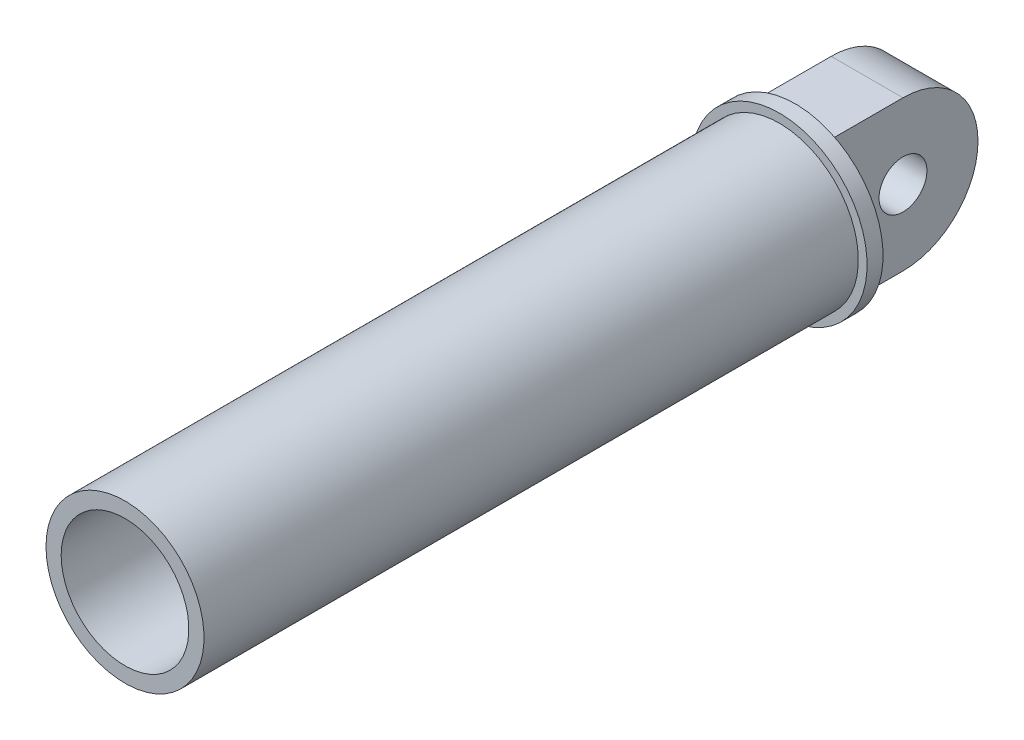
ISO-10303-21;
HEADER;
FILE_DESCRIPTION(('STEP AP214'),'2;1');
FILE_NAME('part.step','',(''),(''),'','','');
FILE_SCHEMA(('AUTOMOTIVE_DESIGN { 1 0 10303 214 1 1 1 1 }'));
ENDSEC;
DATA;
#1=APPLICATION_CONTEXT('core data for automotive mechanical design processes');
#2=APPLICATION_PROTOCOL_DEFINITION('international standard','automotive_design',2000,#1);
#3=PRODUCT_CONTEXT('',#1,'mechanical');
#4=PRODUCT('Part','Part','',(#3));
#5=PRODUCT_RELATED_PRODUCT_CATEGORY('part','',(#4));
#6=PRODUCT_DEFINITION_FORMATION('','',#4);
#7=PRODUCT_DEFINITION_CONTEXT('part definition',#1,'design');
#8=PRODUCT_DEFINITION('design','',#6,#7);
#9=PRODUCT_DEFINITION_SHAPE('','',#8);
#10=(LENGTH_UNIT() NAMED_UNIT(*) SI_UNIT(.MILLI.,.METRE.));
#11=(NAMED_UNIT(*) PLANE_ANGLE_UNIT() SI_UNIT($,.RADIAN.));
#12=(NAMED_UNIT(*) SI_UNIT($,.STERADIAN.) SOLID_ANGLE_UNIT());
#13=UNCERTAINTY_MEASURE_WITH_UNIT(LENGTH_MEASURE(1.E-05),#10,'distance_accuracy_value','');
#14=(GEOMETRIC_REPRESENTATION_CONTEXT(3) GLOBAL_UNCERTAINTY_ASSIGNED_CONTEXT((#13)) GLOBAL_UNIT_ASSIGNED_CONTEXT((#10,
#11,#12)) REPRESENTATION_CONTEXT('',''));
#15=CARTESIAN_POINT('',(0.,0.,0.));
#16=DIRECTION('',(0.,0.,1.));
#17=DIRECTION('',(1.,0.,0.));
#18=AXIS2_PLACEMENT_3D('',#15,#16,#17);
#19=CARTESIAN_POINT('',(0.,0.,-10.));
#20=DIRECTION('',(0.,0.,-1.));
#21=DIRECTION('',(-1.,0.,0.));
#22=AXIS2_PLACEMENT_3D('',#19,#20,#21);
#23=PLANE('',#22);
#24=CARTESIAN_POINT('',(0.,0.,-10.));
#25=DIRECTION('',(0.,0.,-1.));
#26=DIRECTION('',(-1.,0.,0.));
#27=AXIS2_PLACEMENT_3D('',#24,#25,#26);
#28=CIRCLE('',#27,55.);
#29=CARTESIAN_POINT('',(-55.,0.,-10.));
#30=VERTEX_POINT('',#29);
#31=EDGE_CURVE('E127',#30,#30,#28,.T.);
#32=ORIENTED_EDGE('',*,*,#31,.T.);
#33=EDGE_LOOP('',(#32));
#34=FACE_BOUND('',#33,.T.);
#35=DIRECTION('',(0.,-1.,0.));
#36=VECTOR('',#35,1.);
#37=CARTESIAN_POINT('',(22.5,47.,-10.));
#38=LINE('',#37,#36);
#39=CARTESIAN_POINT('',(22.5,47.,-10.));
#40=VERTEX_POINT('',#39);
#41=CARTESIAN_POINT('',(22.5,-47.,-10.));
#42=VERTEX_POINT('',#41);
#43=EDGE_CURVE('E118',#40,#42,#38,.T.);
#44=ORIENTED_EDGE('',*,*,#43,.F.);
#45=DIRECTION('',(-1.,0.,0.));
#46=VECTOR('',#45,1.);
#47=CARTESIAN_POINT('',(22.5,47.,-10.));
#48=LINE('',#47,#46);
#49=CARTESIAN_POINT('',(-22.5,47.,-10.));
#50=VERTEX_POINT('',#49);
#51=EDGE_CURVE('E100',#40,#50,#48,.T.);
#52=ORIENTED_EDGE('',*,*,#51,.T.);
#53=DIRECTION('',(0.,-1.,0.));
#54=VECTOR('',#53,1.);
#55=CARTESIAN_POINT('',(-22.5,47.,-10.));
#56=LINE('',#55,#54);
#57=CARTESIAN_POINT('',(-22.5,-47.,-10.));
#58=VERTEX_POINT('',#57);
#59=EDGE_CURVE('E88',#50,#58,#56,.T.);
#60=ORIENTED_EDGE('',*,*,#59,.T.);
#61=DIRECTION('',(-1.,0.,0.));
#62=VECTOR('',#61,1.);
#63=CARTESIAN_POINT('',(22.5,-47.,-10.));
#64=LINE('',#63,#62);
#65=EDGE_CURVE('E122',#42,#58,#64,.T.);
#66=ORIENTED_EDGE('',*,*,#65,.F.);
#67=EDGE_LOOP('',(#44,#52,#60,#66));
#68=FACE_BOUND('',#67,.T.);
#69=ADVANCED_FACE('F41',(#34,#68),#23,.T.);
#70=CARTESIAN_POINT('',(0.,0.,410.));
#71=DIRECTION('',(0.,0.,1.));
#72=DIRECTION('',(1.,0.,0.));
#73=AXIS2_PLACEMENT_3D('',#70,#71,#72);
#74=PLANE('',#73);
#75=CARTESIAN_POINT('',(0.,0.,410.));
#76=DIRECTION('',(0.,0.,1.));
#77=DIRECTION('',(1.,0.,0.));
#78=AXIS2_PLACEMENT_3D('',#75,#76,#77);
#79=CIRCLE('',#78,49.5);
#80=CARTESIAN_POINT('',(-49.5,0.,410.));
#81=VERTEX_POINT('',#80);
#82=EDGE_CURVE('E49',#81,#81,#79,.T.);
#83=ORIENTED_EDGE('',*,*,#82,.T.);
#84=EDGE_LOOP('',(#83));
#85=FACE_BOUND('',#84,.T.);
#86=CARTESIAN_POINT('',(0.,0.,410.));
#87=DIRECTION('',(0.,0.,1.));
#88=DIRECTION('',(1.,0.,0.));
#89=AXIS2_PLACEMENT_3D('',#86,#87,#88);
#90=CIRCLE('',#89,40.);
#91=CARTESIAN_POINT('',(-40.,0.,410.));
#92=VERTEX_POINT('',#91);
#93=EDGE_CURVE('E133',#92,#92,#90,.T.);
#94=ORIENTED_EDGE('',*,*,#93,.F.);
#95=EDGE_LOOP('',(#94));
#96=FACE_BOUND('',#95,.T.);
#97=ADVANCED_FACE('F138',(#85,#96),#74,.T.);
#98=CARTESIAN_POINT('',(0.,0.,410.));
#99=DIRECTION('',(0.,0.,-1.));
#100=DIRECTION('',(-1.,0.,0.));
#101=AXIS2_PLACEMENT_3D('',#98,#99,#100);
#102=CYLINDRICAL_SURFACE('',#101,49.5);
#103=CARTESIAN_POINT('',(0.,0.,0.));
#104=DIRECTION('',(0.,0.,-1.));
#105=DIRECTION('',(-1.,0.,0.));
#106=AXIS2_PLACEMENT_3D('',#103,#104,#105);
#107=CIRCLE('',#106,49.5);
#108=CARTESIAN_POINT('',(-49.5,0.,0.));
#109=VERTEX_POINT('',#108);
#110=EDGE_CURVE('E130',#109,#109,#107,.T.);
#111=CARTESIAN_POINT('',(-49.5,0.,410.));
#112=CARTESIAN_POINT('',(-49.5,0.,405.729166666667));
#113=CARTESIAN_POINT('',(-49.5,0.,401.458333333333));
#114=CARTESIAN_POINT('',(-49.5,0.,392.916666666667));
#115=CARTESIAN_POINT('',(-49.5,0.,388.645833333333));
#116=CARTESIAN_POINT('',(-49.5,0.,380.104166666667));
#117=CARTESIAN_POINT('',(-49.5,0.,375.833333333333));
#118=CARTESIAN_POINT('',(-49.5,0.,367.291666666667));
#119=CARTESIAN_POINT('',(-49.5,0.,363.020833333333));
#120=CARTESIAN_POINT('',(-49.5,0.,354.479166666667));
#121=CARTESIAN_POINT('',(-49.5,0.,350.208333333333));
#122=CARTESIAN_POINT('',(-49.5,0.,341.666666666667));
#123=CARTESIAN_POINT('',(-49.5,0.,337.395833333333));
#124=CARTESIAN_POINT('',(-49.5,0.,328.854166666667));
#125=CARTESIAN_POINT('',(-49.5,0.,324.583333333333));
#126=CARTESIAN_POINT('',(-49.5,0.,316.041666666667));
#127=CARTESIAN_POINT('',(-49.5,0.,311.770833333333));
#128=CARTESIAN_POINT('',(-49.5,0.,303.229166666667));
#129=CARTESIAN_POINT('',(-49.5,0.,298.958333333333));
#130=CARTESIAN_POINT('',(-49.5,0.,290.416666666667));
#131=CARTESIAN_POINT('',(-49.5,0.,286.145833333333));
#132=CARTESIAN_POINT('',(-49.5,0.,277.604166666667));
#133=CARTESIAN_POINT('',(-49.5,0.,273.333333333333));
#134=CARTESIAN_POINT('',(-49.5,0.,264.791666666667));
#135=CARTESIAN_POINT('',(-49.5,0.,260.520833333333));
#136=CARTESIAN_POINT('',(-49.5,0.,251.979166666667));
#137=CARTESIAN_POINT('',(-49.5,0.,247.708333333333));
#138=CARTESIAN_POINT('',(-49.5,0.,239.166666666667));
#139=CARTESIAN_POINT('',(-49.5,0.,234.895833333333));
#140=CARTESIAN_POINT('',(-49.5,0.,226.354166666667));
#141=CARTESIAN_POINT('',(-49.5,0.,222.083333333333));
#142=CARTESIAN_POINT('',(-49.5,0.,213.541666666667));
#143=CARTESIAN_POINT('',(-49.5,0.,209.270833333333));
#144=CARTESIAN_POINT('',(-49.5,0.,200.729166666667));
#145=CARTESIAN_POINT('',(-49.5,0.,196.458333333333));
#146=CARTESIAN_POINT('',(-49.5,0.,187.916666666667));
#147=CARTESIAN_POINT('',(-49.5,0.,183.645833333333));
#148=CARTESIAN_POINT('',(-49.5,0.,175.104166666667));
#149=CARTESIAN_POINT('',(-49.5,0.,170.833333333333));
#150=CARTESIAN_POINT('',(-49.5,0.,162.291666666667));
#151=CARTESIAN_POINT('',(-49.5,0.,158.020833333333));
#152=CARTESIAN_POINT('',(-49.5,0.,149.479166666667));
#153=CARTESIAN_POINT('',(-49.5,0.,145.208333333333));
#154=CARTESIAN_POINT('',(-49.5,0.,136.666666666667));
#155=CARTESIAN_POINT('',(-49.5,0.,132.395833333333));
#156=CARTESIAN_POINT('',(-49.5,0.,123.854166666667));
#157=CARTESIAN_POINT('',(-49.5,0.,119.583333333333));
#158=CARTESIAN_POINT('',(-49.5,0.,111.041666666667));
#159=CARTESIAN_POINT('',(-49.5,0.,106.770833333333));
#160=CARTESIAN_POINT('',(-49.5,0.,98.2291666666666));
#161=CARTESIAN_POINT('',(-49.5,0.,93.9583333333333));
#162=CARTESIAN_POINT('',(-49.5,0.,85.4166666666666));
#163=CARTESIAN_POINT('',(-49.5,0.,81.1458333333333));
#164=CARTESIAN_POINT('',(-49.5,0.,72.6041666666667));
#165=CARTESIAN_POINT('',(-49.5,0.,68.3333333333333));
#166=CARTESIAN_POINT('',(-49.5,0.,59.7916666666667));
#167=CARTESIAN_POINT('',(-49.5,0.,55.5208333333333));
#168=CARTESIAN_POINT('',(-49.5,0.,46.9791666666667));
#169=CARTESIAN_POINT('',(-49.5,0.,42.7083333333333));
#170=CARTESIAN_POINT('',(-49.5,0.,34.1666666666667));
#171=CARTESIAN_POINT('',(-49.5,0.,29.8958333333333));
#172=CARTESIAN_POINT('',(-49.5,0.,21.3541666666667));
#173=CARTESIAN_POINT('',(-49.5,0.,17.0833333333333));
#174=CARTESIAN_POINT('',(-49.5,0.,8.54166666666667));
#175=CARTESIAN_POINT('',(-49.5,0.,4.27083333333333));
#176=CARTESIAN_POINT('',(-49.5,0.,0.));
#177=B_SPLINE_CURVE_WITH_KNOTS('',3,(#111,#112,#113,#114,#115,#116,#117,#118,#119,#120,#121,
#122,#123,#124,#125,#126,#127,#128,#129,#130,#131,#132,#133,#134,#135,#136,#137,#138,#139,#140,
#141,#142,#143,#144,#145,#146,#147,#148,#149,#150,#151,#152,#153,#154,#155,#156,#157,#158,#159,
#160,#161,#162,#163,#164,#165,#166,#167,#168,#169,#170,#171,#172,#173,#174,#175,#176),
.UNSPECIFIED.,.F.,.F.,(4,2,2,2,2,2,2,2,2,2,2,2,2,2,2,2,2,2,2,2,2,2,2,2,2,2,2,2,2,2,2,2,4),(0.,
12.8124999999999,25.625,38.4375,51.25,64.0625,76.875,89.6874999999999,102.5,115.3125,128.125,
140.9375,153.75,166.5625,179.375,192.1875,205.,217.8125,230.625,243.4375,256.25,269.0625,
281.875,294.6875,307.5,320.3125,333.125,345.9375,358.75,371.5625,384.375,397.1875,410.),.UNSPECIFIED.);
#178=EDGE_CURVE('BSEAM43',#81,#109,#177,.T.);
#179=ORIENTED_EDGE('',*,*,#82,.F.);
#180=ORIENTED_EDGE('',*,*,#110,.F.);
#181=ORIENTED_EDGE('',*,*,#178,.T.);
#182=ORIENTED_EDGE('',*,*,#178,.F.);
#183=EDGE_LOOP('',(#179,#181,#180,#182));
#184=FACE_BOUND('',#183,.T.);
#185=ADVANCED_FACE('F43',(#184),#102,.T.);
#186=CARTESIAN_POINT('',(0.,0.,410.));
#187=DIRECTION('',(0.,0.,-1.));
#188=DIRECTION('',(-1.,0.,0.));
#189=AXIS2_PLACEMENT_3D('',#186,#187,#188);
#190=CYLINDRICAL_SURFACE('',#189,40.);
#191=CARTESIAN_POINT('',(0.,0.,10.));
#192=DIRECTION('',(0.,0.,1.));
#193=DIRECTION('',(1.,0.,0.));
#194=AXIS2_PLACEMENT_3D('',#191,#192,#193);
#195=CIRCLE('',#194,40.);
#196=CARTESIAN_POINT('',(-40.,0.,10.));
#197=VERTEX_POINT('',#196);
#198=EDGE_CURVE('E11',#197,#197,#195,.T.);
#199=CARTESIAN_POINT('',(-40.,0.,10.));
#200=CARTESIAN_POINT('',(-40.,0.,14.1666666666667));
#201=CARTESIAN_POINT('',(-40.,0.,18.3333333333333));
#202=CARTESIAN_POINT('',(-40.,0.,26.6666666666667));
#203=CARTESIAN_POINT('',(-40.,0.,30.8333333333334));
#204=CARTESIAN_POINT('',(-40.,0.,39.1666666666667));
#205=CARTESIAN_POINT('',(-40.,0.,43.3333333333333));
#206=CARTESIAN_POINT('',(-40.,0.,51.6666666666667));
#207=CARTESIAN_POINT('',(-40.,0.,55.8333333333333));
#208=CARTESIAN_POINT('',(-40.,0.,64.1666666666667));
#209=CARTESIAN_POINT('',(-40.,0.,68.3333333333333));
#210=CARTESIAN_POINT('',(-40.,0.,76.6666666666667));
#211=CARTESIAN_POINT('',(-40.,0.,80.8333333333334));
#212=CARTESIAN_POINT('',(-40.,0.,89.1666666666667));
#213=CARTESIAN_POINT('',(-40.,0.,93.3333333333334));
#214=CARTESIAN_POINT('',(-40.,0.,101.666666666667));
#215=CARTESIAN_POINT('',(-40.,0.,105.833333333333));
#216=CARTESIAN_POINT('',(-40.,0.,114.166666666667));
#217=CARTESIAN_POINT('',(-40.,0.,118.333333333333));
#218=CARTESIAN_POINT('',(-40.,0.,126.666666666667));
#219=CARTESIAN_POINT('',(-40.,0.,130.833333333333));
#220=CARTESIAN_POINT('',(-40.,0.,139.166666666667));
#221=CARTESIAN_POINT('',(-40.,0.,143.333333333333));
#222=CARTESIAN_POINT('',(-40.,0.,151.666666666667));
#223=CARTESIAN_POINT('',(-40.,0.,155.833333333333));
#224=CARTESIAN_POINT('',(-40.,0.,164.166666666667));
#225=CARTESIAN_POINT('',(-40.,0.,168.333333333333));
#226=CARTESIAN_POINT('',(-40.,0.,176.666666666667));
#227=CARTESIAN_POINT('',(-40.,0.,180.833333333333));
#228=CARTESIAN_POINT('',(-40.,0.,189.166666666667));
#229=CARTESIAN_POINT('',(-40.,0.,193.333333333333));
#230=CARTESIAN_POINT('',(-40.,0.,201.666666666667));
#231=CARTESIAN_POINT('',(-40.,0.,205.833333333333));
#232=CARTESIAN_POINT('',(-40.,0.,214.166666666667));
#233=CARTESIAN_POINT('',(-40.,0.,218.333333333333));
#234=CARTESIAN_POINT('',(-40.,0.,226.666666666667));
#235=CARTESIAN_POINT('',(-40.,0.,230.833333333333));
#236=CARTESIAN_POINT('',(-40.,0.,239.166666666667));
#237=CARTESIAN_POINT('',(-40.,0.,243.333333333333));
#238=CARTESIAN_POINT('',(-40.,0.,251.666666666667));
#239=CARTESIAN_POINT('',(-40.,0.,255.833333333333));
#240=CARTESIAN_POINT('',(-40.,0.,264.166666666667));
#241=CARTESIAN_POINT('',(-40.,0.,268.333333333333));
#242=CARTESIAN_POINT('',(-40.,0.,276.666666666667));
#243=CARTESIAN_POINT('',(-40.,0.,280.833333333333));
#244=CARTESIAN_POINT('',(-40.,0.,289.166666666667));
#245=CARTESIAN_POINT('',(-40.,0.,293.333333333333));
#246=CARTESIAN_POINT('',(-40.,0.,301.666666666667));
#247=CARTESIAN_POINT('',(-40.,0.,305.833333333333));
#248=CARTESIAN_POINT('',(-40.,0.,314.166666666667));
#249=CARTESIAN_POINT('',(-40.,0.,318.333333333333));
#250=CARTESIAN_POINT('',(-40.,0.,326.666666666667));
#251=CARTESIAN_POINT('',(-40.,0.,330.833333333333));
#252=CARTESIAN_POINT('',(-40.,0.,339.166666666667));
#253=CARTESIAN_POINT('',(-40.,0.,343.333333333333));
#254=CARTESIAN_POINT('',(-40.,0.,351.666666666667));
#255=CARTESIAN_POINT('',(-40.,0.,355.833333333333));
#256=CARTESIAN_POINT('',(-40.,0.,364.166666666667));
#257=CARTESIAN_POINT('',(-40.,0.,368.333333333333));
#258=CARTESIAN_POINT('',(-40.,0.,376.666666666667));
#259=CARTESIAN_POINT('',(-40.,0.,380.833333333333));
#260=CARTESIAN_POINT('',(-40.,0.,389.166666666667));
#261=CARTESIAN_POINT('',(-40.,0.,393.333333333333));
#262=CARTESIAN_POINT('',(-40.,0.,401.666666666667));
#263=CARTESIAN_POINT('',(-40.,0.,405.833333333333));
#264=CARTESIAN_POINT('',(-40.,0.,410.));
#265=B_SPLINE_CURVE_WITH_KNOTS('',3,(#199,#200,#201,#202,#203,#204,#205,#206,#207,#208,#209,
#210,#211,#212,#213,#214,#215,#216,#217,#218,#219,#220,#221,#222,#223,#224,#225,#226,#227,#228,
#229,#230,#231,#232,#233,#234,#235,#236,#237,#238,#239,#240,#241,#242,#243,#244,#245,#246,#247,
#248,#249,#250,#251,#252,#253,#254,#255,#256,#257,#258,#259,#260,#261,#262,#263,#264),
.UNSPECIFIED.,.F.,.F.,(4,2,2,2,2,2,2,2,2,2,2,2,2,2,2,2,2,2,2,2,2,2,2,2,2,2,2,2,2,2,2,2,4),(0.,
12.5,25.,37.5,50.,62.5,75.,87.5,100.,112.5,125.,137.5,150.,162.5,175.,187.5,200.,212.5,225.,
237.5,250.,262.5,275.,287.5,300.,312.5,325.,337.5,350.,362.5,375.,387.5,400.),.UNSPECIFIED.);
#266=EDGE_CURVE('BSEAM143',#197,#92,#265,.T.);
#267=ORIENTED_EDGE('',*,*,#198,.F.);
#268=ORIENTED_EDGE('',*,*,#93,.T.);
#269=ORIENTED_EDGE('',*,*,#266,.T.);
#270=ORIENTED_EDGE('',*,*,#266,.F.);
#271=EDGE_LOOP('',(#267,#269,#268,#270));
#272=FACE_BOUND('',#271,.T.);
#273=ADVANCED_FACE('F143',(#272),#190,.F.);
#274=CARTESIAN_POINT('',(0.,0.,0.));
#275=DIRECTION('',(0.,0.,-1.));
#276=DIRECTION('',(-1.,0.,0.));
#277=AXIS2_PLACEMENT_3D('',#274,#275,#276);
#278=PLANE('',#277);
#279=CARTESIAN_POINT('',(0.,0.,0.));
#280=DIRECTION('',(0.,0.,-1.));
#281=DIRECTION('',(-1.,0.,0.));
#282=AXIS2_PLACEMENT_3D('',#279,#280,#281);
#283=CIRCLE('',#282,55.);
#284=CARTESIAN_POINT('',(-55.,0.,0.));
#285=VERTEX_POINT('',#284);
#286=EDGE_CURVE('E99',#285,#285,#283,.T.);
#287=ORIENTED_EDGE('',*,*,#286,.F.);
#288=EDGE_LOOP('',(#287));
#289=FACE_BOUND('',#288,.T.);
#290=ORIENTED_EDGE('',*,*,#110,.T.);
#291=EDGE_LOOP('',(#290));
#292=FACE_BOUND('',#291,.T.);
#293=ADVANCED_FACE('F146',(#289,#292),#278,.F.);
#294=CARTESIAN_POINT('',(0.,0.,-10.));
#295=DIRECTION('',(0.,0.,1.));
#296=DIRECTION('',(1.,0.,0.));
#297=AXIS2_PLACEMENT_3D('',#294,#295,#296);
#298=CYLINDRICAL_SURFACE('',#297,55.);
#299=ORIENTED_EDGE('',*,*,#31,.F.);
#300=EDGE_LOOP('',(#299));
#301=FACE_BOUND('',#300,.T.);
#302=ORIENTED_EDGE('',*,*,#286,.T.);
#303=EDGE_LOOP('',(#302));
#304=FACE_BOUND('',#303,.T.);
#305=ADVANCED_FACE('F148',(#301,#304),#298,.T.);
#306=CARTESIAN_POINT('',(0.,0.,10.));
#307=DIRECTION('',(0.,0.,1.));
#308=DIRECTION('',(1.,0.,0.));
#309=AXIS2_PLACEMENT_3D('',#306,#307,#308);
#310=PLANE('',#309);
#311=ORIENTED_EDGE('',*,*,#198,.T.);
#312=EDGE_LOOP('',(#311));
#313=FACE_BOUND('',#312,.T.);
#314=ADVANCED_FACE('F154',(#313),#310,.T.);
#315=CARTESIAN_POINT('',(22.5,0.,-55.));
#316=DIRECTION('',(1.,0.,0.));
#317=DIRECTION('',(0.,0.,-1.));
#318=AXIS2_PLACEMENT_3D('',#315,#316,#317);
#319=PLANE('',#318);
#320=CARTESIAN_POINT('',(22.5,0.,-55.));
#321=DIRECTION('',(1.,0.,0.));
#322=DIRECTION('',(0.,0.,-1.));
#323=AXIS2_PLACEMENT_3D('',#320,#321,#322);
#324=CIRCLE('',#323,47.);
#325=CARTESIAN_POINT('',(22.5,-47.,-55.));
#326=VERTEX_POINT('',#325);
#327=CARTESIAN_POINT('',(22.5,47.,-55.));
#328=VERTEX_POINT('',#327);
#329=EDGE_CURVE('E115',#326,#328,#324,.T.);
#330=ORIENTED_EDGE('',*,*,#329,.T.);
#331=DIRECTION('',(0.,0.,1.));
#332=VECTOR('',#331,1.);
#333=CARTESIAN_POINT('',(22.5,47.,-55.));
#334=LINE('',#333,#332);
#335=EDGE_CURVE('E96',#328,#40,#334,.T.);
#336=ORIENTED_EDGE('',*,*,#335,.T.);
#337=ORIENTED_EDGE('',*,*,#43,.T.);
#338=DIRECTION('',(0.,0.,-1.));
#339=VECTOR('',#338,1.);
#340=CARTESIAN_POINT('',(22.5,-47.,-10.));
#341=LINE('',#340,#339);
#342=EDGE_CURVE('E56',#42,#326,#341,.T.);
#343=ORIENTED_EDGE('',*,*,#342,.T.);
#344=EDGE_LOOP('',(#330,#336,#337,#343));
#345=FACE_BOUND('',#344,.T.);
#346=CARTESIAN_POINT('',(22.5,0.,-55.));
#347=DIRECTION('',(1.,0.,0.));
#348=DIRECTION('',(0.,0.,-1.));
#349=AXIS2_PLACEMENT_3D('',#346,#347,#348);
#350=CIRCLE('',#349,15.);
#351=CARTESIAN_POINT('',(22.5,0.,-40.));
#352=VERTEX_POINT('',#351);
#353=EDGE_CURVE('E105',#352,#352,#350,.T.);
#354=ORIENTED_EDGE('',*,*,#353,.F.);
#355=EDGE_LOOP('',(#354));
#356=FACE_BOUND('',#355,.T.);
#357=ADVANCED_FACE('F174',(#345,#356),#319,.T.);
#358=CARTESIAN_POINT('',(-22.5,0.,-55.));
#359=DIRECTION('',(1.,0.,0.));
#360=DIRECTION('',(0.,0.,-1.));
#361=AXIS2_PLACEMENT_3D('',#358,#359,#360);
#362=PLANE('',#361);
#363=CARTESIAN_POINT('',(-22.5,0.,-55.));
#364=DIRECTION('',(1.,0.,0.));
#365=DIRECTION('',(0.,0.,-1.));
#366=AXIS2_PLACEMENT_3D('',#363,#364,#365);
#367=CIRCLE('',#366,47.);
#368=CARTESIAN_POINT('',(-22.5,-47.,-55.));
#369=VERTEX_POINT('',#368);
#370=CARTESIAN_POINT('',(-22.5,47.,-55.));
#371=VERTEX_POINT('',#370);
#372=EDGE_CURVE('E86',#369,#371,#367,.T.);
#373=ORIENTED_EDGE('',*,*,#372,.F.);
#374=DIRECTION('',(0.,0.,-1.));
#375=VECTOR('',#374,1.);
#376=CARTESIAN_POINT('',(-22.5,-47.,-10.));
#377=LINE('',#376,#375);
#378=EDGE_CURVE('E113',#58,#369,#377,.T.);
#379=ORIENTED_EDGE('',*,*,#378,.F.);
#380=ORIENTED_EDGE('',*,*,#59,.F.);
#381=DIRECTION('',(0.,0.,1.));
#382=VECTOR('',#381,1.);
#383=CARTESIAN_POINT('',(-22.5,47.,-55.));
#384=LINE('',#383,#382);
#385=EDGE_CURVE('E80',#371,#50,#384,.T.);
#386=ORIENTED_EDGE('',*,*,#385,.F.);
#387=EDGE_LOOP('',(#373,#379,#380,#386));
#388=FACE_BOUND('',#387,.T.);
#389=CARTESIAN_POINT('',(-22.5,0.,-55.));
#390=DIRECTION('',(1.,0.,0.));
#391=DIRECTION('',(0.,0.,-1.));
#392=AXIS2_PLACEMENT_3D('',#389,#390,#391);
#393=CIRCLE('',#392,15.);
#394=CARTESIAN_POINT('',(-22.5,0.,-40.));
#395=VERTEX_POINT('',#394);
#396=EDGE_CURVE('E108',#395,#395,#393,.T.);
#397=ORIENTED_EDGE('',*,*,#396,.T.);
#398=EDGE_LOOP('',(#397));
#399=FACE_BOUND('',#398,.T.);
#400=ADVANCED_FACE('F82',(#388,#399),#362,.F.);
#401=CARTESIAN_POINT('',(22.5,0.,-55.));
#402=DIRECTION('',(-1.,0.,0.));
#403=DIRECTION('',(0.,0.,1.));
#404=AXIS2_PLACEMENT_3D('',#401,#402,#403);
#405=CYLINDRICAL_SURFACE('',#404,47.);
#406=ORIENTED_EDGE('',*,*,#372,.T.);
#407=DIRECTION('',(-1.,0.,0.));
#408=VECTOR('',#407,1.);
#409=CARTESIAN_POINT('',(22.5,47.,-55.));
#410=LINE('',#409,#408);
#411=EDGE_CURVE('E94',#328,#371,#410,.T.);
#412=ORIENTED_EDGE('',*,*,#411,.F.);
#413=ORIENTED_EDGE('',*,*,#329,.F.);
#414=DIRECTION('',(-1.,0.,0.));
#415=VECTOR('',#414,1.);
#416=CARTESIAN_POINT('',(22.5,-47.,-55.));
#417=LINE('',#416,#415);
#418=EDGE_CURVE('E104',#326,#369,#417,.T.);
#419=ORIENTED_EDGE('',*,*,#418,.T.);
#420=EDGE_LOOP('',(#406,#412,#413,#419));
#421=FACE_BOUND('',#420,.T.);
#422=ADVANCED_FACE('F103',(#421),#405,.T.);
#423=CARTESIAN_POINT('',(22.5,47.,-55.));
#424=DIRECTION('',(0.,-1.,0.));
#425=DIRECTION('',(0.,0.,-1.));
#426=AXIS2_PLACEMENT_3D('',#423,#424,#425);
#427=PLANE('',#426);
#428=ORIENTED_EDGE('',*,*,#385,.T.);
#429=ORIENTED_EDGE('',*,*,#51,.F.);
#430=ORIENTED_EDGE('',*,*,#335,.F.);
#431=ORIENTED_EDGE('',*,*,#411,.T.);
#432=EDGE_LOOP('',(#428,#429,#430,#431));
#433=FACE_BOUND('',#432,.T.);
#434=ADVANCED_FACE('F95',(#433),#427,.F.);
#435=CARTESIAN_POINT('',(22.5,-47.,-10.));
#436=DIRECTION('',(0.,1.,0.));
#437=DIRECTION('',(0.,0.,1.));
#438=AXIS2_PLACEMENT_3D('',#435,#436,#437);
#439=PLANE('',#438);
#440=ORIENTED_EDGE('',*,*,#378,.T.);
#441=ORIENTED_EDGE('',*,*,#418,.F.);
#442=ORIENTED_EDGE('',*,*,#342,.F.);
#443=ORIENTED_EDGE('',*,*,#65,.T.);
#444=EDGE_LOOP('',(#440,#441,#442,#443));
#445=FACE_BOUND('',#444,.T.);
#446=ADVANCED_FACE('F182',(#445),#439,.F.);
#447=CARTESIAN_POINT('',(22.5,0.,-55.));
#448=DIRECTION('',(-1.,0.,0.));
#449=DIRECTION('',(0.,0.,1.));
#450=AXIS2_PLACEMENT_3D('',#447,#448,#449);
#451=CYLINDRICAL_SURFACE('',#450,15.);
#452=CARTESIAN_POINT('',(22.5,0.,-40.));
#453=CARTESIAN_POINT('',(22.03125,0.,-40.));
#454=CARTESIAN_POINT('',(21.5625,0.,-40.));
#455=CARTESIAN_POINT('',(20.625,0.,-40.));
#456=CARTESIAN_POINT('',(20.15625,0.,-40.));
#457=CARTESIAN_POINT('',(19.21875,0.,-40.));
#458=CARTESIAN_POINT('',(18.75,0.,-40.));
#459=CARTESIAN_POINT('',(17.8125,0.,-40.));
#460=CARTESIAN_POINT('',(17.34375,0.,-40.));
#461=CARTESIAN_POINT('',(16.40625,0.,-40.));
#462=CARTESIAN_POINT('',(15.9375,0.,-40.));
#463=CARTESIAN_POINT('',(15.,0.,-40.));
#464=CARTESIAN_POINT('',(14.53125,0.,-40.));
#465=CARTESIAN_POINT('',(13.59375,0.,-40.));
#466=CARTESIAN_POINT('',(13.125,0.,-40.));
#467=CARTESIAN_POINT('',(12.1875,0.,-40.));
#468=CARTESIAN_POINT('',(11.71875,0.,-40.));
#469=CARTESIAN_POINT('',(10.78125,0.,-40.));
#470=CARTESIAN_POINT('',(10.3125,0.,-40.));
#471=CARTESIAN_POINT('',(9.37499999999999,0.,-40.));
#472=CARTESIAN_POINT('',(8.90625,0.,-40.));
#473=CARTESIAN_POINT('',(7.96874999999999,0.,-40.));
#474=CARTESIAN_POINT('',(7.5,0.,-40.));
#475=CARTESIAN_POINT('',(6.5625,0.,-40.));
#476=CARTESIAN_POINT('',(6.09375,0.,-40.));
#477=CARTESIAN_POINT('',(5.15625,0.,-40.));
#478=CARTESIAN_POINT('',(4.6875,0.,-40.));
#479=CARTESIAN_POINT('',(3.75,0.,-40.));
#480=CARTESIAN_POINT('',(3.28125,0.,-40.));
#481=CARTESIAN_POINT('',(2.34375,0.,-40.));
#482=CARTESIAN_POINT('',(1.875,0.,-40.));
#483=CARTESIAN_POINT('',(0.937499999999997,0.,-40.));
#484=CARTESIAN_POINT('',(0.468749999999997,0.,-40.));
#485=CARTESIAN_POINT('',(-0.468750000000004,0.,-40.));
#486=CARTESIAN_POINT('',(-0.937500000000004,0.,-40.));
#487=CARTESIAN_POINT('',(-1.87500000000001,0.,-40.));
#488=CARTESIAN_POINT('',(-2.34375000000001,0.,-40.));
#489=CARTESIAN_POINT('',(-3.28125,0.,-40.));
#490=CARTESIAN_POINT('',(-3.75,0.,-40.));
#491=CARTESIAN_POINT('',(-4.6875,0.,-40.));
#492=CARTESIAN_POINT('',(-5.15625,0.,-40.));
#493=CARTESIAN_POINT('',(-6.09375000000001,0.,-40.));
#494=CARTESIAN_POINT('',(-6.56250000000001,0.,-40.));
#495=CARTESIAN_POINT('',(-7.50000000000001,0.,-40.));
#496=CARTESIAN_POINT('',(-7.96875000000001,0.,-40.));
#497=CARTESIAN_POINT('',(-8.90625,0.,-40.));
#498=CARTESIAN_POINT('',(-9.37500000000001,0.,-40.));
#499=CARTESIAN_POINT('',(-10.3125,0.,-40.));
#500=CARTESIAN_POINT('',(-10.78125,0.,-40.));
#501=CARTESIAN_POINT('',(-11.71875,0.,-40.));
#502=CARTESIAN_POINT('',(-12.1875,0.,-40.));
#503=CARTESIAN_POINT('',(-13.125,0.,-40.));
#504=CARTESIAN_POINT('',(-13.59375,0.,-40.));
#505=CARTESIAN_POINT('',(-14.53125,0.,-40.));
#506=CARTESIAN_POINT('',(-15.,0.,-40.));
#507=CARTESIAN_POINT('',(-15.9375,0.,-40.));
#508=CARTESIAN_POINT('',(-16.40625,0.,-40.));
#509=CARTESIAN_POINT('',(-17.34375,0.,-40.));
#510=CARTESIAN_POINT('',(-17.8125,0.,-40.));
#511=CARTESIAN_POINT('',(-18.75,0.,-40.));
#512=CARTESIAN_POINT('',(-19.21875,0.,-40.));
#513=CARTESIAN_POINT('',(-20.15625,0.,-40.));
#514=CARTESIAN_POINT('',(-20.625,0.,-40.));
#515=CARTESIAN_POINT('',(-21.5625,0.,-40.));
#516=CARTESIAN_POINT('',(-22.03125,0.,-40.));
#517=CARTESIAN_POINT('',(-22.5,0.,-40.));
#518=B_SPLINE_CURVE_WITH_KNOTS('',3,(#452,#453,#454,#455,#456,#457,#458,#459,#460,#461,#462,
#463,#464,#465,#466,#467,#468,#469,#470,#471,#472,#473,#474,#475,#476,#477,#478,#479,#480,#481,
#482,#483,#484,#485,#486,#487,#488,#489,#490,#491,#492,#493,#494,#495,#496,#497,#498,#499,#500,
#501,#502,#503,#504,#505,#506,#507,#508,#509,#510,#511,#512,#513,#514,#515,#516,#517),
.UNSPECIFIED.,.F.,.F.,(4,2,2,2,2,2,2,2,2,2,2,2,2,2,2,2,2,2,2,2,2,2,2,2,2,2,2,2,2,2,2,2,4),(0.,
1.40625,2.8125,4.21875,5.625,7.03125,8.4375,9.84375,11.25,12.65625,14.0625,15.46875,16.875,
18.28125,19.6875,21.09375,22.5,23.90625,25.3125,26.71875,28.125,29.53125,30.9375,32.34375,33.75,
35.15625,36.5625,37.96875,39.375,40.78125,42.1875,43.59375,45.),.UNSPECIFIED.);
#519=EDGE_CURVE('BSEAM179',#352,#395,#518,.T.);
#520=ORIENTED_EDGE('',*,*,#353,.T.);
#521=ORIENTED_EDGE('',*,*,#396,.F.);
#522=ORIENTED_EDGE('',*,*,#519,.T.);
#523=ORIENTED_EDGE('',*,*,#519,.F.);
#524=EDGE_LOOP('',(#520,#522,#521,#523));
#525=FACE_BOUND('',#524,.T.);
#526=ADVANCED_FACE('F179',(#525),#451,.F.);
#527=CLOSED_SHELL('',(#69,#97,#185,#273,#293,#305,#314,#357,#400,#422,#434,#446,#526));
#528=MANIFOLD_SOLID_BREP('B2',#527);
#529=ADVANCED_BREP_SHAPE_REPRESENTATION('',(#18,#528),#14);
#530=SHAPE_DEFINITION_REPRESENTATION(#9,#529);
ENDSEC;
END-ISO-10303-21;
